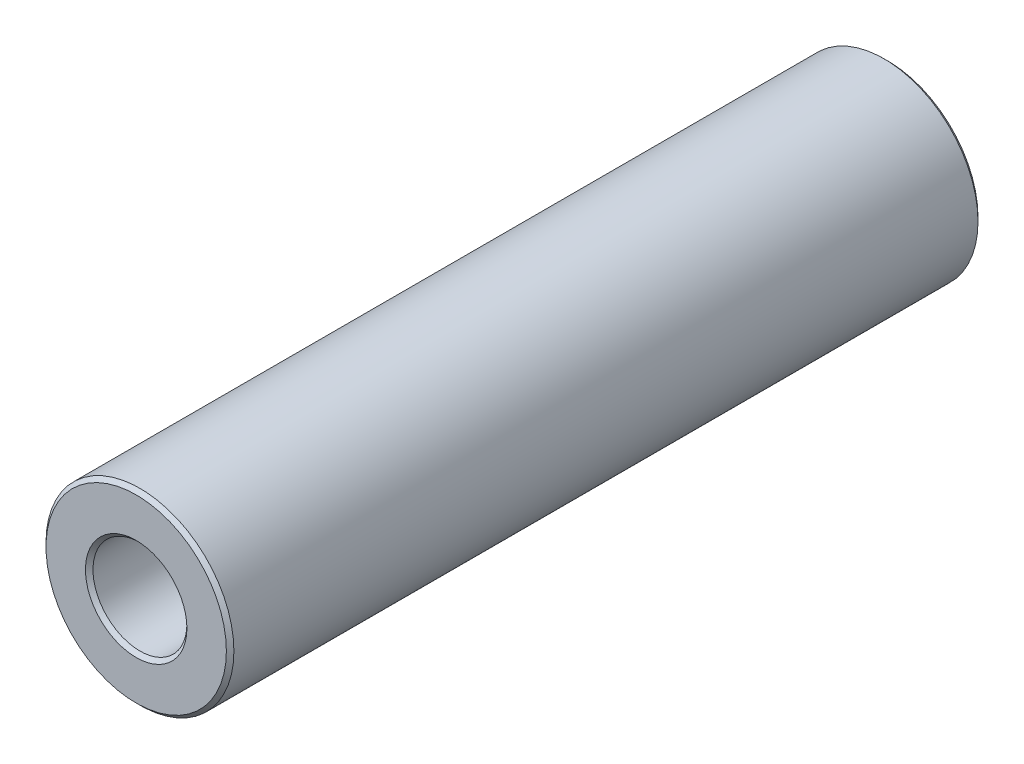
ISO-10303-21;
HEADER;
FILE_DESCRIPTION(('STEP AP214'),'2;1');
FILE_NAME('part.step','',(''),(''),'','','');
FILE_SCHEMA(('AUTOMOTIVE_DESIGN { 1 0 10303 214 1 1 1 1 }'));
ENDSEC;
DATA;
#1=APPLICATION_CONTEXT('core data for automotive mechanical design processes');
#2=APPLICATION_PROTOCOL_DEFINITION('international standard','automotive_design',2000,#1);
#3=PRODUCT_CONTEXT('',#1,'mechanical');
#4=PRODUCT('Part','Part','',(#3));
#5=PRODUCT_RELATED_PRODUCT_CATEGORY('part','',(#4));
#6=PRODUCT_DEFINITION_FORMATION('','',#4);
#7=PRODUCT_DEFINITION_CONTEXT('part definition',#1,'design');
#8=PRODUCT_DEFINITION('design','',#6,#7);
#9=PRODUCT_DEFINITION_SHAPE('','',#8);
#10=(LENGTH_UNIT() NAMED_UNIT(*) SI_UNIT(.MILLI.,.METRE.));
#11=(NAMED_UNIT(*) PLANE_ANGLE_UNIT() SI_UNIT($,.RADIAN.));
#12=(NAMED_UNIT(*) SI_UNIT($,.STERADIAN.) SOLID_ANGLE_UNIT());
#13=UNCERTAINTY_MEASURE_WITH_UNIT(LENGTH_MEASURE(1.E-05),#10,'distance_accuracy_value','');
#14=(GEOMETRIC_REPRESENTATION_CONTEXT(3) GLOBAL_UNCERTAINTY_ASSIGNED_CONTEXT((#13)) GLOBAL_UNIT_ASSIGNED_CONTEXT((#10,
#11,#12)) REPRESENTATION_CONTEXT('',''));
#15=CARTESIAN_POINT('',(0.,0.,0.));
#16=DIRECTION('',(0.,0.,1.));
#17=DIRECTION('',(1.,0.,0.));
#18=AXIS2_PLACEMENT_3D('',#15,#16,#17);
#19=CARTESIAN_POINT('',(0.,0.,10.));
#20=DIRECTION('',(0.,0.,1.));
#21=DIRECTION('',(1.,0.,0.));
#22=AXIS2_PLACEMENT_3D('',#19,#20,#21);
#23=PLANE('',#22);
#24=CARTESIAN_POINT('',(0.,0.,10.));
#25=DIRECTION('',(0.,0.,1.));
#26=DIRECTION('',(1.,0.,0.));
#27=AXIS2_PLACEMENT_3D('',#24,#25,#26);
#28=CIRCLE('',#27,1.35);
#29=CARTESIAN_POINT('',(1.35,0.,10.));
#30=VERTEX_POINT('',#29);
#31=EDGE_CURVE('E10',#30,#30,#28,.F.);
#32=ORIENTED_EDGE('',*,*,#31,.T.);
#33=EDGE_LOOP('',(#32));
#34=FACE_BOUND('',#33,.T.);
#35=CARTESIAN_POINT('',(0.,0.,10.));
#36=DIRECTION('',(0.,0.,1.));
#37=DIRECTION('',(1.,0.,0.));
#38=AXIS2_PLACEMENT_3D('',#35,#36,#37);
#39=CIRCLE('',#38,2.4);
#40=CARTESIAN_POINT('',(2.4,0.,10.));
#41=VERTEX_POINT('',#40);
#42=EDGE_CURVE('E45',#41,#41,#39,.T.);
#43=ORIENTED_EDGE('',*,*,#42,.T.);
#44=EDGE_LOOP('',(#43));
#45=FACE_BOUND('',#44,.T.);
#46=ADVANCED_FACE('F37',(#34,#45),#23,.T.);
#47=CARTESIAN_POINT('',(0.,0.,-10.));
#48=DIRECTION('',(0.,0.,1.));
#49=DIRECTION('',(1.,0.,0.));
#50=AXIS2_PLACEMENT_3D('',#47,#48,#49);
#51=PLANE('',#50);
#52=CARTESIAN_POINT('',(0.,0.,-10.));
#53=DIRECTION('',(0.,0.,1.));
#54=DIRECTION('',(1.,0.,0.));
#55=AXIS2_PLACEMENT_3D('',#52,#53,#54);
#56=CIRCLE('',#55,2.4);
#57=CARTESIAN_POINT('',(2.4,0.,-10.));
#58=VERTEX_POINT('',#57);
#59=EDGE_CURVE('E63',#58,#58,#56,.F.);
#60=ORIENTED_EDGE('',*,*,#59,.T.);
#61=EDGE_LOOP('',(#60));
#62=FACE_BOUND('',#61,.T.);
#63=CARTESIAN_POINT('',(0.,0.,-10.));
#64=DIRECTION('',(0.,0.,1.));
#65=DIRECTION('',(1.,0.,0.));
#66=AXIS2_PLACEMENT_3D('',#63,#64,#65);
#67=CIRCLE('',#66,1.35);
#68=CARTESIAN_POINT('',(1.35,0.,-10.));
#69=VERTEX_POINT('',#68);
#70=EDGE_CURVE('E67',#69,#69,#67,.T.);
#71=ORIENTED_EDGE('',*,*,#70,.T.);
#72=EDGE_LOOP('',(#71));
#73=FACE_BOUND('',#72,.T.);
#74=ADVANCED_FACE('F89',(#62,#73),#51,.F.);
#75=CARTESIAN_POINT('',(0.,0.,10.));
#76=DIRECTION('',(0.,0.,-1.));
#77=DIRECTION('',(-1.,0.,0.));
#78=AXIS2_PLACEMENT_3D('',#75,#76,#77);
#79=CYLINDRICAL_SURFACE('',#78,2.5);
#80=CARTESIAN_POINT('',(0.,0.,-9.9));
#81=DIRECTION('',(0.,0.,1.));
#82=DIRECTION('',(1.,0.,0.));
#83=AXIS2_PLACEMENT_3D('',#80,#81,#82);
#84=CIRCLE('',#83,2.5);
#85=CARTESIAN_POINT('',(2.5,0.,-9.9));
#86=VERTEX_POINT('',#85);
#87=EDGE_CURVE('E71',#86,#86,#84,.T.);
#88=ORIENTED_EDGE('',*,*,#87,.T.);
#89=EDGE_LOOP('',(#88));
#90=FACE_BOUND('',#89,.T.);
#91=CARTESIAN_POINT('',(0.,0.,9.9));
#92=DIRECTION('',(0.,0.,1.));
#93=DIRECTION('',(1.,0.,0.));
#94=AXIS2_PLACEMENT_3D('',#91,#92,#93);
#95=CIRCLE('',#94,2.5);
#96=CARTESIAN_POINT('',(2.5,0.,9.9));
#97=VERTEX_POINT('',#96);
#98=EDGE_CURVE('E74',#97,#97,#95,.F.);
#99=ORIENTED_EDGE('',*,*,#98,.T.);
#100=EDGE_LOOP('',(#99));
#101=FACE_BOUND('',#100,.T.);
#102=ADVANCED_FACE('F78',(#90,#101),#79,.T.);
#103=CARTESIAN_POINT('',(0.,0.,10.));
#104=DIRECTION('',(0.,0.,-1.));
#105=DIRECTION('',(-1.,0.,0.));
#106=AXIS2_PLACEMENT_3D('',#103,#104,#105);
#107=CYLINDRICAL_SURFACE('',#106,1.25);
#108=CARTESIAN_POINT('',(0.,0.,-9.9));
#109=DIRECTION('',(0.,0.,1.));
#110=DIRECTION('',(1.,0.,0.));
#111=AXIS2_PLACEMENT_3D('',#108,#109,#110);
#112=CIRCLE('',#111,1.25);
#113=CARTESIAN_POINT('',(1.25,0.,-9.9));
#114=VERTEX_POINT('',#113);
#115=EDGE_CURVE('E51',#114,#114,#112,.F.);
#116=ORIENTED_EDGE('',*,*,#115,.T.);
#117=EDGE_LOOP('',(#116));
#118=FACE_BOUND('',#117,.T.);
#119=CARTESIAN_POINT('',(0.,0.,9.9));
#120=DIRECTION('',(0.,0.,1.));
#121=DIRECTION('',(1.,0.,0.));
#122=AXIS2_PLACEMENT_3D('',#119,#120,#121);
#123=CIRCLE('',#122,1.25);
#124=CARTESIAN_POINT('',(1.25,0.,9.9));
#125=VERTEX_POINT('',#124);
#126=EDGE_CURVE('E57',#125,#125,#123,.T.);
#127=ORIENTED_EDGE('',*,*,#126,.T.);
#128=EDGE_LOOP('',(#127));
#129=FACE_BOUND('',#128,.T.);
#130=ADVANCED_FACE('F97',(#118,#129),#107,.F.);
#131=CARTESIAN_POINT('',(0.,0.,-9.9));
#132=DIRECTION('',(0.,0.,1.));
#133=DIRECTION('',(1.,0.,0.));
#134=AXIS2_PLACEMENT_3D('',#131,#132,#133);
#135=CONICAL_SURFACE('',#134,2.5,0.785398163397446);
#136=ORIENTED_EDGE('',*,*,#59,.F.);
#137=EDGE_LOOP('',(#136));
#138=FACE_BOUND('',#137,.T.);
#139=ORIENTED_EDGE('',*,*,#87,.F.);
#140=EDGE_LOOP('',(#139));
#141=FACE_BOUND('',#140,.T.);
#142=ADVANCED_FACE('F102',(#138,#141),#135,.T.);
#143=CARTESIAN_POINT('',(0.,0.,-10.));
#144=DIRECTION('',(0.,0.,-1.));
#145=DIRECTION('',(-1.,0.,0.));
#146=AXIS2_PLACEMENT_3D('',#143,#144,#145);
#147=CONICAL_SURFACE('',#146,1.35,0.785398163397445);
#148=ORIENTED_EDGE('',*,*,#115,.F.);
#149=EDGE_LOOP('',(#148));
#150=FACE_BOUND('',#149,.T.);
#151=ORIENTED_EDGE('',*,*,#70,.F.);
#152=EDGE_LOOP('',(#151));
#153=FACE_BOUND('',#152,.T.);
#154=ADVANCED_FACE('F86',(#150,#153),#147,.F.);
#155=CARTESIAN_POINT('',(0.,0.,9.9));
#156=DIRECTION('',(0.,0.,1.));
#157=DIRECTION('',(1.,0.,0.));
#158=AXIS2_PLACEMENT_3D('',#155,#156,#157);
#159=CONICAL_SURFACE('',#158,1.25,0.785398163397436);
#160=ORIENTED_EDGE('',*,*,#31,.F.);
#161=EDGE_LOOP('',(#160));
#162=FACE_BOUND('',#161,.T.);
#163=ORIENTED_EDGE('',*,*,#126,.F.);
#164=EDGE_LOOP('',(#163));
#165=FACE_BOUND('',#164,.T.);
#166=ADVANCED_FACE('F82',(#162,#165),#159,.F.);
#167=CARTESIAN_POINT('',(0.,0.,10.));
#168=DIRECTION('',(0.,0.,-1.));
#169=DIRECTION('',(-1.,0.,0.));
#170=AXIS2_PLACEMENT_3D('',#167,#168,#169);
#171=CONICAL_SURFACE('',#170,2.4,0.785398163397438);
#172=ORIENTED_EDGE('',*,*,#98,.F.);
#173=EDGE_LOOP('',(#172));
#174=FACE_BOUND('',#173,.T.);
#175=ORIENTED_EDGE('',*,*,#42,.F.);
#176=EDGE_LOOP('',(#175));
#177=FACE_BOUND('',#176,.T.);
#178=ADVANCED_FACE('F39',(#174,#177),#171,.T.);
#179=CLOSED_SHELL('',(#46,#74,#102,#130,#142,#154,#166,#178));
#180=MANIFOLD_SOLID_BREP('B2',#179);
#181=ADVANCED_BREP_SHAPE_REPRESENTATION('',(#18,#180),#14);
#182=SHAPE_DEFINITION_REPRESENTATION(#9,#181);
ENDSEC;
END-ISO-10303-21;
